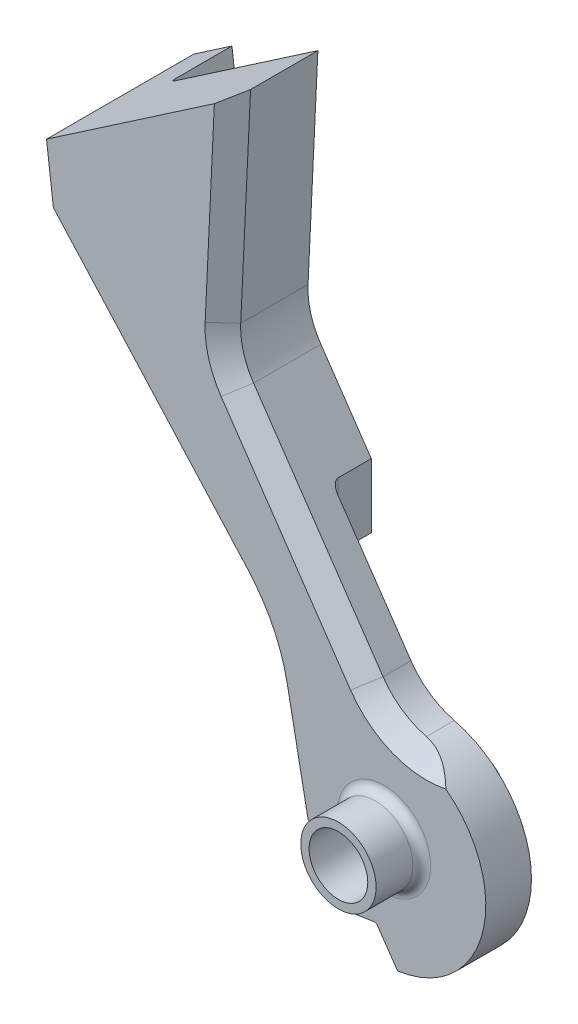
ISO-10303-21;
HEADER;
FILE_DESCRIPTION(('STEP AP214'),'2;1');
FILE_NAME('part.step','',(''),(''),'','','');
FILE_SCHEMA(('AUTOMOTIVE_DESIGN { 1 0 10303 214 1 1 1 1 }'));
ENDSEC;
DATA;
#1=APPLICATION_CONTEXT('core data for automotive mechanical design processes');
#2=APPLICATION_PROTOCOL_DEFINITION('international standard','automotive_design',2000,#1);
#3=PRODUCT_CONTEXT('',#1,'mechanical');
#4=PRODUCT('Part','Part','',(#3));
#5=PRODUCT_RELATED_PRODUCT_CATEGORY('part','',(#4));
#6=PRODUCT_DEFINITION_FORMATION('','',#4);
#7=PRODUCT_DEFINITION_CONTEXT('part definition',#1,'design');
#8=PRODUCT_DEFINITION('design','',#6,#7);
#9=PRODUCT_DEFINITION_SHAPE('','',#8);
#10=(LENGTH_UNIT() NAMED_UNIT(*) SI_UNIT(.MILLI.,.METRE.));
#11=(NAMED_UNIT(*) PLANE_ANGLE_UNIT() SI_UNIT($,.RADIAN.));
#12=(NAMED_UNIT(*) SI_UNIT($,.STERADIAN.) SOLID_ANGLE_UNIT());
#13=UNCERTAINTY_MEASURE_WITH_UNIT(LENGTH_MEASURE(1.E-05),#10,'distance_accuracy_value','');
#14=(GEOMETRIC_REPRESENTATION_CONTEXT(3) GLOBAL_UNCERTAINTY_ASSIGNED_CONTEXT((#13)) GLOBAL_UNIT_ASSIGNED_CONTEXT((#10,
#11,#12)) REPRESENTATION_CONTEXT('',''));
#15=CARTESIAN_POINT('',(0.,0.,0.));
#16=DIRECTION('',(0.,0.,1.));
#17=DIRECTION('',(1.,0.,0.));
#18=AXIS2_PLACEMENT_3D('',#15,#16,#17);
#19=CARTESIAN_POINT('',(0.,0.,0.));
#20=DIRECTION('',(0.,0.,1.));
#21=DIRECTION('',(1.,0.,0.));
#22=AXIS2_PLACEMENT_3D('',#19,#20,#21);
#23=PLANE('',#22);
#24=DIRECTION('',(0.669130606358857,-0.743144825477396,0.));
#25=VECTOR('',#24,1.);
#26=CARTESIAN_POINT('',(0.60615256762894,0.545782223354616,0.));
#27=LINE('',#26,#25);
#28=CARTESIAN_POINT('',(-23.6414355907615,27.4754570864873,0.));
#29=VERTEX_POINT('',#28);
#30=CARTESIAN_POINT('',(-11.6865027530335,14.198159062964,0.));
#31=VERTEX_POINT('',#30);
#32=EDGE_CURVE('E480',#29,#31,#27,.T.);
#33=ORIENTED_EDGE('',*,*,#32,.F.);
#34=DIRECTION('',(0.121869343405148,-0.992546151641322,0.));
#35=VECTOR('',#34,1.);
#36=CARTESIAN_POINT('',(-25.148905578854,39.752814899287,0.));
#37=LINE('',#36,#35);
#38=CARTESIAN_POINT('',(-25.1809115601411,40.0134826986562,0.));
#39=VERTEX_POINT('',#38);
#40=EDGE_CURVE('E53',#29,#39,#37,.F.);
#41=ORIENTED_EDGE('',*,*,#40,.T.);
#42=DIRECTION('',(0.825724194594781,0.564074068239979,0.));
#43=VECTOR('',#42,1.);
#44=CARTESIAN_POINT('',(-26.6491152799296,39.0105138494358,0.));
#45=LINE('',#44,#43);
#46=CARTESIAN_POINT('',(-12.9595659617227,48.3622075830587,0.));
#47=VERTEX_POINT('',#46);
#48=EDGE_CURVE('E478',#39,#47,#45,.T.);
#49=ORIENTED_EDGE('',*,*,#48,.T.);
#50=DIRECTION('',(-0.0474551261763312,-0.998873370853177,0.));
#51=VECTOR('',#50,1.);
#52=CARTESIAN_POINT('',(-15.2228301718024,0.723216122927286,0.));
#53=LINE('',#52,#51);
#54=CARTESIAN_POINT('',(-13.8035749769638,30.5968322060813,0.));
#55=VERTEX_POINT('',#54);
#56=EDGE_CURVE('E475',#47,#55,#53,.T.);
#57=ORIENTED_EDGE('',*,*,#56,.T.);
#58=CARTESIAN_POINT('',(-7.4607290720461,30.2954921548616,0.));
#59=DIRECTION('',(0.,0.,1.));
#60=DIRECTION('',(1.,0.,0.));
#61=AXIS2_PLACEMENT_3D('',#58,#59,#60);
#62=CIRCLE('',#61,6.35);
#63=CARTESIAN_POINT('',(-12.7040777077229,26.7136218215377,0.));
#64=VERTEX_POINT('',#63);
#65=EDGE_CURVE('E435',#55,#64,#62,.T.);
#66=ORIENTED_EDGE('',*,*,#65,.T.);
#67=DIRECTION('',(0.564074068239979,-0.825724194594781,0.));
#68=VECTOR('',#67,1.);
#69=CARTESIAN_POINT('',(3.7804931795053,2.58255502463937,0.));
#70=LINE('',#69,#68);
#71=CARTESIAN_POINT('',(-8.382,20.3867148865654,0.));
#72=VERTEX_POINT('',#71);
#73=EDGE_CURVE('E234',#64,#72,#70,.T.);
#74=ORIENTED_EDGE('',*,*,#73,.T.);
#75=DIRECTION('',(0.,1.,0.));
#76=VECTOR('',#75,1.);
#77=CARTESIAN_POINT('',(-8.382,24.13,0.));
#78=LINE('',#77,#76);
#79=CARTESIAN_POINT('',(-8.382,14.8838210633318,0.));
#80=VERTEX_POINT('',#79);
#81=EDGE_CURVE('E218',#80,#72,#78,.T.);
#82=ORIENTED_EDGE('',*,*,#81,.F.);
#83=DIRECTION('',(-0.825724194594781,-0.564074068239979,0.));
#84=VECTOR('',#83,1.);
#85=CARTESIAN_POINT('',(-9.59941249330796,14.052174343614,0.));
#86=LINE('',#85,#84);
#87=CARTESIAN_POINT('',(-10.8599833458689,13.1910450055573,0.));
#88=VERTEX_POINT('',#87);
#89=EDGE_CURVE('E230',#80,#88,#86,.T.);
#90=ORIENTED_EDGE('',*,*,#89,.T.);
#91=CARTESIAN_POINT('',(-22.256994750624,4.68044531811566,0.));
#92=DIRECTION('',(0.,0.,1.));
#93=DIRECTION('',(1.,0.,0.));
#94=AXIS2_PLACEMENT_3D('',#91,#92,#93);
#95=CIRCLE('',#94,14.224);
#96=EDGE_CURVE('E433',#31,#88,#95,.F.);
#97=ORIENTED_EDGE('',*,*,#96,.F.);
#98=EDGE_LOOP('',(#33,#41,#49,#57,#66,#74,#82,#90,#97));
#99=FACE_BOUND('',#98,.T.);
#100=ADVANCED_FACE('F37',(#99),#23,.F.);
#101=CARTESIAN_POINT('',(0.,0.,7.2898));
#102=DIRECTION('',(0.,0.,1.));
#103=DIRECTION('',(1.,0.,0.));
#104=AXIS2_PLACEMENT_3D('',#101,#102,#103);
#105=PLANE('',#104);
#106=CARTESIAN_POINT('',(0.,0.,7.2898));
#107=DIRECTION('',(0.,0.,1.));
#108=DIRECTION('',(1.,0.,0.));
#109=AXIS2_PLACEMENT_3D('',#106,#107,#108);
#110=CIRCLE('',#109,3.9878);
#111=CARTESIAN_POINT('',(3.9878,0.,7.2898));
#112=VERTEX_POINT('',#111);
#113=EDGE_CURVE('E257',#112,#112,#110,.F.);
#114=ORIENTED_EDGE('',*,*,#113,.T.);
#115=EDGE_LOOP('',(#114));
#116=FACE_BOUND('',#115,.T.);
#117=CARTESIAN_POINT('',(0.,-0.5588,7.2898));
#118=DIRECTION('',(0.,0.,1.));
#119=DIRECTION('',(1.,0.,0.));
#120=AXIS2_PLACEMENT_3D('',#117,#118,#119);
#121=CIRCLE('',#120,8.7122);
#122=CARTESIAN_POINT('',(1.15333806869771,-9.19432199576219,7.2898));
#123=VERTEX_POINT('',#122);
#124=CARTESIAN_POINT('',(5.29143049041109,6.36241320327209,7.2898));
#125=VERTEX_POINT('',#124);
#126=EDGE_CURVE('E458',#123,#125,#121,.T.);
#127=ORIENTED_EDGE('',*,*,#126,.T.);
#128=CARTESIAN_POINT('',(3.63065940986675,14.0592772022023,7.2898));
#129=DIRECTION('',(0.,0.,1.));
#130=DIRECTION('',(1.,0.,0.));
#131=AXIS2_PLACEMENT_3D('',#128,#129,#130);
#132=CIRCLE('',#131,7.874);
#133=CARTESIAN_POINT('',(-2.87109289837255,9.61775798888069,7.2898));
#134=VERTEX_POINT('',#133);
#135=EDGE_CURVE('E278',#125,#134,#132,.F.);
#136=ORIENTED_EDGE('',*,*,#135,.T.);
#137=DIRECTION('',(-0.564074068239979,0.825724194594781,0.));
#138=VECTOR('',#137,1.);
#139=CARTESIAN_POINT('',(2.52208950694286,1.72290614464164,7.2898));
#140=LINE('',#139,#138);
#141=CARTESIAN_POINT('',(-13.9624813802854,25.85397294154,7.2898));
#142=VERTEX_POINT('',#141);
#143=EDGE_CURVE('E271',#134,#142,#140,.T.);
#144=ORIENTED_EDGE('',*,*,#143,.T.);
#145=CARTESIAN_POINT('',(-7.4607290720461,30.2954921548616,7.2898));
#146=DIRECTION('',(0.,0.,1.));
#147=DIRECTION('',(1.,0.,0.));
#148=AXIS2_PLACEMENT_3D('',#145,#146,#147);
#149=CIRCLE('',#148,7.87400000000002);
#150=CARTESIAN_POINT('',(-15.325857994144,30.6691538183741,7.2898));
#151=VERTEX_POINT('',#150);
#152=EDGE_CURVE('E265',#142,#151,#149,.F.);
#153=ORIENTED_EDGE('',*,*,#152,.T.);
#154=DIRECTION('',(0.0474551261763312,0.998873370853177,0.));
#155=VECTOR('',#154,1.);
#156=CARTESIAN_POINT('',(-16.7451131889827,0.795537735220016,7.2898));
#157=LINE('',#156,#155);
#158=CARTESIAN_POINT('',(-14.5364621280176,47.2849880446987,7.2898));
#159=VERTEX_POINT('',#158);
#160=EDGE_CURVE('E263',#151,#159,#157,.T.);
#161=ORIENTED_EDGE('',*,*,#160,.T.);
#162=DIRECTION('',(0.825724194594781,0.564074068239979,0.));
#163=VECTOR('',#162,1.);
#164=CARTESIAN_POINT('',(-26.6491152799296,39.0105138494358,7.2898));
#165=LINE('',#164,#163);
#166=CARTESIAN_POINT('',(-28.9113505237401,37.4651210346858,7.2898));
#167=VERTEX_POINT('',#166);
#168=EDGE_CURVE('E461',#167,#159,#165,.T.);
#169=ORIENTED_EDGE('',*,*,#168,.F.);
#170=DIRECTION('',(-0.121869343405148,0.992546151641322,0.));
#171=VECTOR('',#170,1.);
#172=CARTESIAN_POINT('',(-23.9501386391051,-2.94070725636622,7.2898));
#173=LINE('',#172,#171);
#174=CARTESIAN_POINT('',(-28.3232090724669,32.6750933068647,7.2898));
#175=VERTEX_POINT('',#174);
#176=EDGE_CURVE('E464',#175,#167,#173,.T.);
#177=ORIENTED_EDGE('',*,*,#176,.F.);
#178=DIRECTION('',(0.669130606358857,-0.743144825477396,0.));
#179=VECTOR('',#178,1.);
#180=CARTESIAN_POINT('',(0.60615256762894,0.545782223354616,7.2898));
#181=LINE('',#180,#179);
#182=CARTESIAN_POINT('',(-11.6865027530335,14.198159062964,7.2898));
#183=VERTEX_POINT('',#182);
#184=EDGE_CURVE('E467',#175,#183,#181,.T.);
#185=ORIENTED_EDGE('',*,*,#184,.T.);
#186=CARTESIAN_POINT('',(-22.256994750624,4.68044531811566,7.2898));
#187=DIRECTION('',(0.,0.,1.));
#188=DIRECTION('',(1.,0.,0.));
#189=AXIS2_PLACEMENT_3D('',#186,#187,#188);
#190=CIRCLE('',#189,14.224);
#191=CARTESIAN_POINT('',(-8.29432969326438,7.39451246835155,7.2898));
#192=VERTEX_POINT('',#191);
#193=EDGE_CURVE('E469',#183,#192,#190,.F.);
#194=ORIENTED_EDGE('',*,*,#193,.T.);
#195=DIRECTION('',(0.190808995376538,-0.981627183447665,0.));
#196=VECTOR('',#195,1.);
#197=CARTESIAN_POINT('',(-6.60733257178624,-1.28433534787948,7.2898));
#198=LINE('',#197,#196);
#199=CARTESIAN_POINT('',(-6.50735484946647,-1.79867614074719,7.2898));
#200=VERTEX_POINT('',#199);
#201=EDGE_CURVE('E471',#192,#200,#198,.T.);
#202=ORIENTED_EDGE('',*,*,#201,.T.);
#203=DIRECTION('',(-0.813100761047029,0.582122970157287,0.));
#204=VECTOR('',#203,1.);
#205=CARTESIAN_POINT('',(-3.05648652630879,-4.26925520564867,7.2898));
#206=LINE('',#205,#204);
#207=CARTESIAN_POINT('',(-3.38169817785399,-4.03642653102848,7.2898));
#208=VERTEX_POINT('',#207);
#209=EDGE_CURVE('E441',#208,#200,#206,.T.);
#210=ORIENTED_EDGE('',*,*,#209,.F.);
#211=CARTESIAN_POINT('',(-3.52955741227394,-4.24295412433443,7.2898));
#212=DIRECTION('',(0.,0.,1.));
#213=DIRECTION('',(1.,0.,0.));
#214=AXIS2_PLACEMENT_3D('',#211,#212,#213);
#215=CIRCLE('',#214,0.254);
#216=CARTESIAN_POINT('',(-3.29506201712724,-4.34056513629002,7.2898));
#217=VERTEX_POINT('',#216);
#218=EDGE_CURVE('E444',#208,#217,#215,.F.);
#219=ORIENTED_EDGE('',*,*,#218,.T.);
#220=DIRECTION('',(0.384295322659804,0.923210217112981,0.));
#221=VECTOR('',#220,1.);
#222=CARTESIAN_POINT('',(-1.26846871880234,0.528012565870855,7.2898));
#223=LINE('',#222,#221);
#224=CARTESIAN_POINT('',(-4.1190259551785,-6.32001136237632,7.2898));
#225=VERTEX_POINT('',#224);
#226=EDGE_CURVE('E446',#225,#217,#223,.T.);
#227=ORIENTED_EDGE('',*,*,#226,.F.);
#228=CARTESIAN_POINT('',(0.,0.,7.2898));
#229=DIRECTION('',(0.,0.,1.));
#230=DIRECTION('',(1.,0.,0.));
#231=AXIS2_PLACEMENT_3D('',#228,#229,#230);
#232=CIRCLE('',#231,7.5438);
#233=CARTESIAN_POINT('',(-3.07186405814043,-6.89003408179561,7.2898));
#234=VERTEX_POINT('',#233);
#235=EDGE_CURVE('E449',#225,#234,#232,.T.);
#236=ORIENTED_EDGE('',*,*,#235,.T.);
#237=DIRECTION('',(-0.98863803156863,-0.15031580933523,0.));
#238=VECTOR('',#237,1.);
#239=CARTESIAN_POINT('',(0.954505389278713,-6.2778515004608,7.2898));
#240=LINE('',#239,#238);
#241=CARTESIAN_POINT('',(-0.847081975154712,-6.55177082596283,7.2898));
#242=VERTEX_POINT('',#241);
#243=EDGE_CURVE('E451',#242,#234,#240,.T.);
#244=ORIENTED_EDGE('',*,*,#243,.F.);
#245=CARTESIAN_POINT('',(-0.808901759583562,-6.80288488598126,7.2898));
#246=DIRECTION('',(0.,0.,1.));
#247=DIRECTION('',(1.,0.,0.));
#248=AXIS2_PLACEMENT_3D('',#245,#246,#247);
#249=CIRCLE('',#248,0.254);
#250=CARTESIAN_POINT('',(-0.599976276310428,-6.65843370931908,7.2898));
#251=VERTEX_POINT('',#250);
#252=EDGE_CURVE('E454',#242,#251,#249,.F.);
#253=ORIENTED_EDGE('',*,*,#252,.T.);
#254=DIRECTION('',(0.568705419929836,-0.82254127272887,0.));
#255=VECTOR('',#254,1.);
#256=CARTESIAN_POINT('',(-3.52063505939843,-2.43416872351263,7.2898));
#257=LINE('',#256,#255);
#258=EDGE_CURVE('E456',#251,#123,#257,.T.);
#259=ORIENTED_EDGE('',*,*,#258,.T.);
#260=EDGE_LOOP('',(#127,#136,#144,#153,#161,#169,#177,#185,#194,#202,#210,#219,#227,#236,#244,
#253,#259));
#261=FACE_BOUND('',#260,.T.);
#262=ADVANCED_FACE('F332',(#116,#261),#105,.T.);
#263=CARTESIAN_POINT('',(-3.05648652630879,-4.26925520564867,7.2898));
#264=DIRECTION('',(-0.582122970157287,-0.813100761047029,0.));
#265=DIRECTION('',(0.813100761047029,-0.582122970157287,0.));
#266=AXIS2_PLACEMENT_3D('',#263,#264,#265);
#267=PLANE('',#266);
#268=DIRECTION('',(-0.813100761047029,0.582122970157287,0.));
#269=VECTOR('',#268,1.);
#270=CARTESIAN_POINT('',(-3.05648652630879,-4.26925520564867,3.3782));
#271=LINE('',#270,#269);
#272=CARTESIAN_POINT('',(-3.38169817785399,-4.03642653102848,3.3782));
#273=VERTEX_POINT('',#272);
#274=CARTESIAN_POINT('',(-6.50735484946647,-1.79867614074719,3.3782));
#275=VERTEX_POINT('',#274);
#276=EDGE_CURVE('E530',#273,#275,#271,.T.);
#277=ORIENTED_EDGE('',*,*,#276,.F.);
#278=DIRECTION('',(0.,0.,-1.));
#279=VECTOR('',#278,1.);
#280=CARTESIAN_POINT('',(-3.38169817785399,-4.03642653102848,7.2898));
#281=LINE('',#280,#279);
#282=EDGE_CURVE('E242',#208,#273,#281,.T.);
#283=ORIENTED_EDGE('',*,*,#282,.F.);
#284=ORIENTED_EDGE('',*,*,#209,.T.);
#285=DIRECTION('',(0.,0.,-1.));
#286=VECTOR('',#285,1.);
#287=CARTESIAN_POINT('',(-6.50735484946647,-1.79867614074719,7.2898));
#288=LINE('',#287,#286);
#289=EDGE_CURVE('E472',#200,#275,#288,.T.);
#290=ORIENTED_EDGE('',*,*,#289,.T.);
#291=EDGE_LOOP('',(#277,#283,#284,#290));
#292=FACE_BOUND('',#291,.T.);
#293=ADVANCED_FACE('F328',(#292),#267,.T.);
#294=CARTESIAN_POINT('',(-3.52955741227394,-4.24295412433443,7.2898));
#295=DIRECTION('',(0.,0.,-1.));
#296=DIRECTION('',(-1.,0.,0.));
#297=AXIS2_PLACEMENT_3D('',#294,#295,#296);
#298=CYLINDRICAL_SURFACE('',#297,0.254);
#299=ORIENTED_EDGE('',*,*,#282,.T.);
#300=CARTESIAN_POINT('',(-3.52955741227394,-4.24295412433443,3.3782));
#301=DIRECTION('',(0.,0.,1.));
#302=DIRECTION('',(1.,0.,0.));
#303=AXIS2_PLACEMENT_3D('',#300,#301,#302);
#304=CIRCLE('',#303,0.254);
#305=CARTESIAN_POINT('',(-3.29506201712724,-4.34056513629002,3.3782));
#306=VERTEX_POINT('',#305);
#307=EDGE_CURVE('E527',#273,#306,#304,.F.);
#308=ORIENTED_EDGE('',*,*,#307,.T.);
#309=DIRECTION('',(0.,0.,-1.));
#310=VECTOR('',#309,1.);
#311=CARTESIAN_POINT('',(-3.29506201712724,-4.34056513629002,7.2898));
#312=LINE('',#311,#310);
#313=EDGE_CURVE('E248',#217,#306,#312,.T.);
#314=ORIENTED_EDGE('',*,*,#313,.F.);
#315=ORIENTED_EDGE('',*,*,#218,.F.);
#316=EDGE_LOOP('',(#299,#308,#314,#315));
#317=FACE_BOUND('',#316,.T.);
#318=ADVANCED_FACE('F324',(#317),#298,.F.);
#319=CARTESIAN_POINT('',(-1.26846871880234,0.528012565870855,7.2898));
#320=DIRECTION('',(-0.923210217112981,0.384295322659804,0.));
#321=DIRECTION('',(-0.384295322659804,-0.923210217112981,0.));
#322=AXIS2_PLACEMENT_3D('',#319,#320,#321);
#323=PLANE('',#322);
#324=DIRECTION('',(0.384295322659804,0.923210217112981,0.));
#325=VECTOR('',#324,1.);
#326=CARTESIAN_POINT('',(-1.26846871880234,0.528012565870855,3.3782));
#327=LINE('',#326,#325);
#328=CARTESIAN_POINT('',(-4.1190259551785,-6.32001136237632,3.3782));
#329=VERTEX_POINT('',#328);
#330=EDGE_CURVE('E522',#329,#306,#327,.T.);
#331=ORIENTED_EDGE('',*,*,#330,.F.);
#332=DIRECTION('',(0.,0.,-1.));
#333=VECTOR('',#332,1.);
#334=CARTESIAN_POINT('',(-4.1190259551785,-6.32001136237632,7.2898));
#335=LINE('',#334,#333);
#336=EDGE_CURVE('E517',#225,#329,#335,.T.);
#337=ORIENTED_EDGE('',*,*,#336,.F.);
#338=ORIENTED_EDGE('',*,*,#226,.T.);
#339=ORIENTED_EDGE('',*,*,#313,.T.);
#340=EDGE_LOOP('',(#331,#337,#338,#339));
#341=FACE_BOUND('',#340,.T.);
#342=ADVANCED_FACE('F320',(#341),#323,.T.);
#343=CARTESIAN_POINT('',(0.,0.,7.2898));
#344=DIRECTION('',(0.,0.,-1.));
#345=DIRECTION('',(-1.,0.,0.));
#346=AXIS2_PLACEMENT_3D('',#343,#344,#345);
#347=CYLINDRICAL_SURFACE('',#346,7.5438);
#348=ORIENTED_EDGE('',*,*,#336,.T.);
#349=CARTESIAN_POINT('',(0.,0.,3.3782));
#350=DIRECTION('',(0.,0.,1.));
#351=DIRECTION('',(1.,0.,0.));
#352=AXIS2_PLACEMENT_3D('',#349,#350,#351);
#353=CIRCLE('',#352,7.5438);
#354=CARTESIAN_POINT('',(-3.07186405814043,-6.89003408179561,3.3782));
#355=VERTEX_POINT('',#354);
#356=EDGE_CURVE('E532',#329,#355,#353,.T.);
#357=ORIENTED_EDGE('',*,*,#356,.T.);
#358=DIRECTION('',(0.,0.,-1.));
#359=VECTOR('',#358,1.);
#360=CARTESIAN_POINT('',(-3.07186405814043,-6.89003408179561,7.2898));
#361=LINE('',#360,#359);
#362=EDGE_CURVE('E514',#234,#355,#361,.T.);
#363=ORIENTED_EDGE('',*,*,#362,.F.);
#364=ORIENTED_EDGE('',*,*,#235,.F.);
#365=EDGE_LOOP('',(#348,#357,#363,#364));
#366=FACE_BOUND('',#365,.T.);
#367=ADVANCED_FACE('F316',(#366),#347,.T.);
#368=CARTESIAN_POINT('',(0.954505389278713,-6.2778515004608,7.2898));
#369=DIRECTION('',(0.15031580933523,-0.98863803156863,0.));
#370=DIRECTION('',(0.98863803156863,0.15031580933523,0.));
#371=AXIS2_PLACEMENT_3D('',#368,#369,#370);
#372=PLANE('',#371);
#373=DIRECTION('',(-0.98863803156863,-0.15031580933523,0.));
#374=VECTOR('',#373,1.);
#375=CARTESIAN_POINT('',(0.954505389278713,-6.2778515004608,3.3782));
#376=LINE('',#375,#374);
#377=CARTESIAN_POINT('',(-0.847081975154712,-6.55177082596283,3.3782));
#378=VERTEX_POINT('',#377);
#379=EDGE_CURVE('E540',#378,#355,#376,.T.);
#380=ORIENTED_EDGE('',*,*,#379,.F.);
#381=DIRECTION('',(0.,0.,-1.));
#382=VECTOR('',#381,1.);
#383=CARTESIAN_POINT('',(-0.847081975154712,-6.55177082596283,7.2898));
#384=LINE('',#383,#382);
#385=EDGE_CURVE('E511',#242,#378,#384,.T.);
#386=ORIENTED_EDGE('',*,*,#385,.F.);
#387=ORIENTED_EDGE('',*,*,#243,.T.);
#388=ORIENTED_EDGE('',*,*,#362,.T.);
#389=EDGE_LOOP('',(#380,#386,#387,#388));
#390=FACE_BOUND('',#389,.T.);
#391=ADVANCED_FACE('F312',(#390),#372,.T.);
#392=CARTESIAN_POINT('',(-0.808901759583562,-6.80288488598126,7.2898));
#393=DIRECTION('',(0.,0.,-1.));
#394=DIRECTION('',(-1.,0.,0.));
#395=AXIS2_PLACEMENT_3D('',#392,#393,#394);
#396=CYLINDRICAL_SURFACE('',#395,0.254);
#397=ORIENTED_EDGE('',*,*,#385,.T.);
#398=CARTESIAN_POINT('',(-0.808901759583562,-6.80288488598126,3.3782));
#399=DIRECTION('',(0.,0.,1.));
#400=DIRECTION('',(1.,0.,0.));
#401=AXIS2_PLACEMENT_3D('',#398,#399,#400);
#402=CIRCLE('',#401,0.254);
#403=CARTESIAN_POINT('',(-0.599976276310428,-6.65843370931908,3.3782));
#404=VERTEX_POINT('',#403);
#405=EDGE_CURVE('E542',#378,#404,#402,.F.);
#406=ORIENTED_EDGE('',*,*,#405,.T.);
#407=DIRECTION('',(0.,0.,-1.));
#408=VECTOR('',#407,1.);
#409=CARTESIAN_POINT('',(-0.599976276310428,-6.65843370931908,7.2898));
#410=LINE('',#409,#408);
#411=EDGE_CURVE('E508',#251,#404,#410,.T.);
#412=ORIENTED_EDGE('',*,*,#411,.F.);
#413=ORIENTED_EDGE('',*,*,#252,.F.);
#414=EDGE_LOOP('',(#397,#406,#412,#413));
#415=FACE_BOUND('',#414,.T.);
#416=ADVANCED_FACE('F308',(#415),#396,.F.);
#417=CARTESIAN_POINT('',(-3.52063505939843,-2.43416872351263,7.2898));
#418=DIRECTION('',(0.82254127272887,0.568705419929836,0.));
#419=DIRECTION('',(-0.568705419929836,0.82254127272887,0.));
#420=AXIS2_PLACEMENT_3D('',#417,#418,#419);
#421=PLANE('',#420);
#422=ORIENTED_EDGE('',*,*,#411,.T.);
#423=DIRECTION('',(0.568705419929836,-0.82254127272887,0.));
#424=VECTOR('',#423,1.);
#425=CARTESIAN_POINT('',(-3.52063505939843,-2.43416872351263,3.3782));
#426=LINE('',#425,#424);
#427=CARTESIAN_POINT('',(1.15333806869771,-9.19432199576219,3.3782));
#428=VERTEX_POINT('',#427);
#429=EDGE_CURVE('E545',#404,#428,#426,.T.);
#430=ORIENTED_EDGE('',*,*,#429,.T.);
#431=DIRECTION('',(0.,0.,-1.));
#432=VECTOR('',#431,1.);
#433=CARTESIAN_POINT('',(1.15333806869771,-9.19432199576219,7.2898));
#434=LINE('',#433,#432);
#435=EDGE_CURVE('E505',#123,#428,#434,.T.);
#436=ORIENTED_EDGE('',*,*,#435,.F.);
#437=ORIENTED_EDGE('',*,*,#258,.F.);
#438=EDGE_LOOP('',(#422,#430,#436,#437));
#439=FACE_BOUND('',#438,.T.);
#440=ADVANCED_FACE('F303',(#439),#421,.F.);
#441=CARTESIAN_POINT('',(0.,-0.5588,7.2898));
#442=DIRECTION('',(0.,0.,-1.));
#443=DIRECTION('',(-1.,0.,0.));
#444=AXIS2_PLACEMENT_3D('',#441,#442,#443);
#445=CYLINDRICAL_SURFACE('',#444,8.7122);
#446=DIRECTION('',(0.,0.,-1.));
#447=VECTOR('',#446,1.);
#448=CARTESIAN_POINT('',(2.10002728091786,7.89651278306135,7.2898));
#449=LINE('',#448,#447);
#450=CARTESIAN_POINT('',(2.10002728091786,7.89651278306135,5.76580000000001));
#451=VERTEX_POINT('',#450);
#452=CARTESIAN_POINT('',(2.10002728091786,7.89651278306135,3.3782));
#453=VERTEX_POINT('',#452);
#454=EDGE_CURVE('E503',#451,#453,#449,.T.);
#455=ORIENTED_EDGE('',*,*,#454,.F.);
#456=CARTESIAN_POINT('',(2.10002728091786,7.89651278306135,5.76580000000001));
#457=CARTESIAN_POINT('',(2.20985746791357,7.86925970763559,5.76571751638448));
#458=CARTESIAN_POINT('',(2.31909260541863,7.83983339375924,5.77102705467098));
#459=CARTESIAN_POINT('',(2.53523958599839,7.77711693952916,5.79178216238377));
#460=CARTESIAN_POINT('',(2.64215566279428,7.74383469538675,5.80720730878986));
#461=CARTESIAN_POINT('',(2.85136839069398,7.6743117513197,5.84724182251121));
#462=CARTESIAN_POINT('',(2.9537106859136,7.63812409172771,5.87170709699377));
#463=CARTESIAN_POINT('',(3.1549813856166,7.56278063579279,5.92886439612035));
#464=CARTESIAN_POINT('',(3.25390790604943,7.52362323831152,5.96156088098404));
#465=CARTESIAN_POINT('',(3.4849134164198,7.4273672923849,6.04791174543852));
#466=CARTESIAN_POINT('',(3.61529649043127,7.36910792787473,6.10480793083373));
#467=CARTESIAN_POINT('',(3.8687568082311,7.2485601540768,6.22951557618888));
#468=CARTESIAN_POINT('',(3.99183041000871,7.18626976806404,6.29733241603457));
#469=CARTESIAN_POINT('',(4.23182104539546,7.05781220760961,6.44207361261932));
#470=CARTESIAN_POINT('',(4.34868550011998,6.99161965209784,6.5190619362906));
#471=CARTESIAN_POINT('',(4.5757160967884,6.85623294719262,6.67981944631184));
#472=CARTESIAN_POINT('',(4.68588420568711,6.7870396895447,6.76358662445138));
#473=CARTESIAN_POINT('',(4.88030122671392,6.65895775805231,6.92048907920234));
#474=CARTESIAN_POINT('',(4.96557985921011,6.60052553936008,6.99273142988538));
#475=CARTESIAN_POINT('',(5.13161083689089,6.48245390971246,7.13954443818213));
#476=CARTESIAN_POINT('',(5.21239538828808,6.42282890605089,7.21409020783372));
#477=CARTESIAN_POINT('',(5.29143049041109,6.36241320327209,7.2898));
#478=B_SPLINE_CURVE_WITH_KNOTS('',3,(#456,#457,#458,#459,#460,#461,#462,#463,#464,#465,#466,
#467,#468,#469,#470,#471,#472,#473,#474,#475,#476,#477),.UNSPECIFIED.,.F.,.F.,(4,2,2,2,2,2,2,2,
2,2,4),(0.,0.339250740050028,0.677818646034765,1.01120774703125,1.34477789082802,
1.80517500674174,2.26579962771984,2.72984907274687,3.19376154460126,3.57201229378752,
3.94706091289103),.UNSPECIFIED.);
#479=EDGE_CURVE('E283',#451,#125,#478,.T.);
#480=ORIENTED_EDGE('',*,*,#479,.T.);
#481=ORIENTED_EDGE('',*,*,#126,.F.);
#482=ORIENTED_EDGE('',*,*,#435,.T.);
#483=CARTESIAN_POINT('',(0.,-0.5588,3.3782));
#484=DIRECTION('',(0.,0.,1.));
#485=DIRECTION('',(1.,0.,0.));
#486=AXIS2_PLACEMENT_3D('',#483,#484,#485);
#487=CIRCLE('',#486,8.7122);
#488=EDGE_CURVE('E548',#428,#453,#487,.T.);
#489=ORIENTED_EDGE('',*,*,#488,.T.);
#490=EDGE_LOOP('',(#455,#480,#481,#482,#489));
#491=FACE_BOUND('',#490,.T.);
#492=ADVANCED_FACE('F297',(#491),#445,.T.);
#493=CARTESIAN_POINT('',(3.63065940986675,14.0592772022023,7.2898));
#494=DIRECTION('',(0.,0.,-1.));
#495=DIRECTION('',(-1.,0.,0.));
#496=AXIS2_PLACEMENT_3D('',#493,#494,#495);
#497=CYLINDRICAL_SURFACE('',#496,6.35);
#498=DIRECTION('',(0.,0.,-1.));
#499=VECTOR('',#498,1.);
#500=CARTESIAN_POINT('',(-1.61268922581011,10.4774068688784,7.2898));
#501=LINE('',#500,#499);
#502=CARTESIAN_POINT('',(-1.61268922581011,10.4774068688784,5.76580000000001));
#503=VERTEX_POINT('',#502);
#504=CARTESIAN_POINT('',(-1.61268922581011,10.4774068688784,3.3782));
#505=VERTEX_POINT('',#504);
#506=EDGE_CURVE('E501',#503,#505,#501,.T.);
#507=ORIENTED_EDGE('',*,*,#506,.F.);
#508=CARTESIAN_POINT('',(3.63065940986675,14.0592772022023,5.76580000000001));
#509=DIRECTION('',(0.,0.,1.));
#510=DIRECTION('',(1.,0.,0.));
#511=AXIS2_PLACEMENT_3D('',#508,#509,#510);
#512=CIRCLE('',#511,6.35);
#513=EDGE_CURVE('E281',#503,#451,#512,.T.);
#514=ORIENTED_EDGE('',*,*,#513,.T.);
#515=ORIENTED_EDGE('',*,*,#454,.T.);
#516=CARTESIAN_POINT('',(3.63065940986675,14.0592772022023,3.3782));
#517=DIRECTION('',(0.,0.,1.));
#518=DIRECTION('',(1.,0.,0.));
#519=AXIS2_PLACEMENT_3D('',#516,#517,#518);
#520=CIRCLE('',#519,6.35);
#521=EDGE_CURVE('E437',#453,#505,#520,.F.);
#522=ORIENTED_EDGE('',*,*,#521,.T.);
#523=EDGE_LOOP('',(#507,#514,#515,#522));
#524=FACE_BOUND('',#523,.T.);
#525=ADVANCED_FACE('F302',(#524),#497,.F.);
#526=CARTESIAN_POINT('',(3.7804931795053,2.58255502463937,7.2898));
#527=DIRECTION('',(0.825724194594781,0.564074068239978,0.));
#528=DIRECTION('',(-0.564074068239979,0.825724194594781,0.));
#529=AXIS2_PLACEMENT_3D('',#526,#527,#528);
#530=PLANE('',#529);
#531=DIRECTION('',(0.564074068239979,-0.825724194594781,0.));
#532=VECTOR('',#531,1.);
#533=CARTESIAN_POINT('',(3.7804931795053,2.58255502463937,3.3782));
#534=LINE('',#533,#532);
#535=CARTESIAN_POINT('',(-7.874,19.6430751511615,3.3782));
#536=VERTEX_POINT('',#535);
#537=EDGE_CURVE('E423',#536,#505,#534,.T.);
#538=ORIENTED_EDGE('',*,*,#537,.F.);
#539=CARTESIAN_POINT('',(-7.874,19.6430751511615,2.8702));
#540=DIRECTION('',(0.825724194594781,0.564074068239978,0.));
#541=DIRECTION('',(0.564074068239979,-0.825724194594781,0.));
#542=AXIS2_PLACEMENT_3D('',#539,#540,#541);
#543=ELLIPSE('',#542,0.900590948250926,0.508);
#544=CARTESIAN_POINT('',(-8.382,20.3867148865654,2.8702));
#545=VERTEX_POINT('',#544);
#546=EDGE_CURVE('E384',#536,#545,#543,.F.);
#547=ORIENTED_EDGE('',*,*,#546,.T.);
#548=DIRECTION('',(0.,0.,1.));
#549=VECTOR('',#548,1.);
#550=CARTESIAN_POINT('',(-8.382,20.3867148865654,7.2898));
#551=LINE('',#550,#549);
#552=EDGE_CURVE('E235',#72,#545,#551,.T.);
#553=ORIENTED_EDGE('',*,*,#552,.F.);
#554=ORIENTED_EDGE('',*,*,#73,.F.);
#555=DIRECTION('',(0.,0.,-1.));
#556=VECTOR('',#555,1.);
#557=CARTESIAN_POINT('',(-12.7040777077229,26.7136218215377,7.2898));
#558=LINE('',#557,#556);
#559=CARTESIAN_POINT('',(-12.7040777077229,26.7136218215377,5.76579999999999));
#560=VERTEX_POINT('',#559);
#561=EDGE_CURVE('E499',#560,#64,#558,.T.);
#562=ORIENTED_EDGE('',*,*,#561,.F.);
#563=DIRECTION('',(0.564074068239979,-0.825724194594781,0.));
#564=VECTOR('',#563,1.);
#565=CARTESIAN_POINT('',(3.7804931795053,2.58255502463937,5.76580000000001));
#566=LINE('',#565,#564);
#567=EDGE_CURVE('E291',#560,#503,#566,.T.);
#568=ORIENTED_EDGE('',*,*,#567,.T.);
#569=ORIENTED_EDGE('',*,*,#506,.T.);
#570=EDGE_LOOP('',(#538,#547,#553,#554,#562,#568,#569));
#571=FACE_BOUND('',#570,.T.);
#572=ADVANCED_FACE('F421',(#571),#530,.T.);
#573=CARTESIAN_POINT('',(-7.4607290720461,30.2954921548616,7.2898));
#574=DIRECTION('',(0.,0.,-1.));
#575=DIRECTION('',(-1.,0.,0.));
#576=AXIS2_PLACEMENT_3D('',#573,#574,#575);
#577=CYLINDRICAL_SURFACE('',#576,6.35);
#578=DIRECTION('',(0.,0.,-1.));
#579=VECTOR('',#578,1.);
#580=CARTESIAN_POINT('',(-13.8035749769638,30.5968322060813,7.2898));
#581=LINE('',#580,#579);
#582=CARTESIAN_POINT('',(-13.8035749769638,30.5968322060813,5.76579999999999));
#583=VERTEX_POINT('',#582);
#584=EDGE_CURVE('E497',#583,#55,#581,.T.);
#585=ORIENTED_EDGE('',*,*,#584,.F.);
#586=CARTESIAN_POINT('',(-7.4607290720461,30.2954921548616,5.76579999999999));
#587=DIRECTION('',(0.,0.,1.));
#588=DIRECTION('',(1.,0.,0.));
#589=AXIS2_PLACEMENT_3D('',#586,#587,#588);
#590=CIRCLE('',#589,6.35);
#591=EDGE_CURVE('E260',#583,#560,#590,.T.);
#592=ORIENTED_EDGE('',*,*,#591,.T.);
#593=ORIENTED_EDGE('',*,*,#561,.T.);
#594=ORIENTED_EDGE('',*,*,#65,.F.);
#595=EDGE_LOOP('',(#585,#592,#593,#594));
#596=FACE_BOUND('',#595,.T.);
#597=ADVANCED_FACE('F560',(#596),#577,.F.);
#598=CARTESIAN_POINT('',(-15.2228301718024,0.723216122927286,7.2898));
#599=DIRECTION('',(0.998873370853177,-0.0474551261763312,0.));
#600=DIRECTION('',(0.0474551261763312,0.998873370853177,0.));
#601=AXIS2_PLACEMENT_3D('',#598,#599,#600);
#602=PLANE('',#601);
#603=DIRECTION('',(0.,0.,-1.));
#604=VECTOR('',#603,1.);
#605=CARTESIAN_POINT('',(-12.9595659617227,48.3622075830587,7.2898));
#606=LINE('',#605,#604);
#607=CARTESIAN_POINT('',(-12.9595659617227,48.3622075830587,5.76579999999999));
#608=VERTEX_POINT('',#607);
#609=EDGE_CURVE('E494',#608,#47,#606,.T.);
#610=ORIENTED_EDGE('',*,*,#609,.F.);
#611=DIRECTION('',(-0.0474551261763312,-0.998873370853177,0.));
#612=VECTOR('',#611,1.);
#613=CARTESIAN_POINT('',(-15.2228301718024,0.723216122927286,5.76579999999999));
#614=LINE('',#613,#612);
#615=EDGE_CURVE('E267',#608,#583,#614,.T.);
#616=ORIENTED_EDGE('',*,*,#615,.T.);
#617=ORIENTED_EDGE('',*,*,#584,.T.);
#618=ORIENTED_EDGE('',*,*,#56,.F.);
#619=EDGE_LOOP('',(#610,#616,#617,#618));
#620=FACE_BOUND('',#619,.T.);
#621=ADVANCED_FACE('F622',(#620),#602,.T.);
#622=CARTESIAN_POINT('',(-26.6491152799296,39.0105138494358,7.2898));
#623=DIRECTION('',(-0.564074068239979,0.825724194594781,0.));
#624=DIRECTION('',(-0.825724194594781,-0.564074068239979,0.));
#625=AXIS2_PLACEMENT_3D('',#622,#623,#624);
#626=PLANE('',#625);
#627=ORIENTED_EDGE('',*,*,#168,.T.);
#628=DIRECTION('',(-0.645403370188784,-0.440892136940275,0.623753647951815));
#629=VECTOR('',#628,1.);
#630=CARTESIAN_POINT('',(-21.9364621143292,42.2298520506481,14.4415708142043));
#631=LINE('',#630,#629);
#632=EDGE_CURVE('E269',#159,#608,#631,.F.);
#633=ORIENTED_EDGE('',*,*,#632,.T.);
#634=ORIENTED_EDGE('',*,*,#609,.T.);
#635=ORIENTED_EDGE('',*,*,#48,.F.);
#636=CARTESIAN_POINT('',(-25.1809115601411,40.0134826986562,-0.508));
#637=DIRECTION('',(-0.564074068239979,0.825724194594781,0.));
#638=DIRECTION('',(0.825724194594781,0.564074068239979,0.));
#639=AXIS2_PLACEMENT_3D('',#636,#637,#638);
#640=ELLIPSE('',#639,0.57187068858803,0.508);
#641=CARTESIAN_POINT('',(-25.6531190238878,39.6909052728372,-0.508));
#642=VERTEX_POINT('',#641);
#643=EDGE_CURVE('E11',#39,#642,#640,.F.);
#644=ORIENTED_EDGE('',*,*,#643,.T.);
#645=DIRECTION('',(0.,0.,1.));
#646=VECTOR('',#645,1.);
#647=CARTESIAN_POINT('',(-25.6531190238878,39.6909052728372,-5.334));
#648=LINE('',#647,#646);
#649=CARTESIAN_POINT('',(-25.6531190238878,39.6909052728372,-5.334));
#650=VERTEX_POINT('',#649);
#651=EDGE_CURVE('E408',#650,#642,#648,.T.);
#652=ORIENTED_EDGE('',*,*,#651,.F.);
#653=DIRECTION('',(0.82572419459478,0.56407406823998,0.));
#654=VECTOR('',#653,1.);
#655=CARTESIAN_POINT('',(-28.9113505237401,37.4651210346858,-5.334));
#656=LINE('',#655,#654);
#657=CARTESIAN_POINT('',(-28.9113505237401,37.4651210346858,-5.334));
#658=VERTEX_POINT('',#657);
#659=EDGE_CURVE('E572',#658,#650,#656,.T.);
#660=ORIENTED_EDGE('',*,*,#659,.F.);
#661=DIRECTION('',(0.,0.,-1.));
#662=VECTOR('',#661,1.);
#663=CARTESIAN_POINT('',(-28.9113505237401,37.4651210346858,7.2898));
#664=LINE('',#663,#662);
#665=EDGE_CURVE('E492',#167,#658,#664,.T.);
#666=ORIENTED_EDGE('',*,*,#665,.F.);
#667=EDGE_LOOP('',(#627,#633,#634,#635,#644,#652,#660,#666));
#668=FACE_BOUND('',#667,.T.);
#669=ADVANCED_FACE('F568',(#668),#626,.T.);
#670=CARTESIAN_POINT('',(-23.9501386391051,-2.94070725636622,7.2898));
#671=DIRECTION('',(-0.992546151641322,-0.121869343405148,0.));
#672=DIRECTION('',(0.121869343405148,-0.992546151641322,0.));
#673=AXIS2_PLACEMENT_3D('',#670,#671,#672);
#674=PLANE('',#673);
#675=ORIENTED_EDGE('',*,*,#665,.T.);
#676=DIRECTION('',(-0.121869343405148,0.992546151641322,0.));
#677=VECTOR('',#676,1.);
#678=CARTESIAN_POINT('',(-28.3232090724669,32.6750933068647,-5.334));
#679=LINE('',#678,#677);
#680=CARTESIAN_POINT('',(-28.3232090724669,32.6750933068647,-5.334));
#681=VERTEX_POINT('',#680);
#682=EDGE_CURVE('E425',#681,#658,#679,.T.);
#683=ORIENTED_EDGE('',*,*,#682,.F.);
#684=DIRECTION('',(0.,0.,-1.));
#685=VECTOR('',#684,1.);
#686=CARTESIAN_POINT('',(-28.3232090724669,32.6750933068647,7.2898));
#687=LINE('',#686,#685);
#688=EDGE_CURVE('E490',#175,#681,#687,.T.);
#689=ORIENTED_EDGE('',*,*,#688,.F.);
#690=ORIENTED_EDGE('',*,*,#176,.T.);
#691=EDGE_LOOP('',(#675,#683,#689,#690));
#692=FACE_BOUND('',#691,.T.);
#693=ADVANCED_FACE('F576',(#692),#674,.T.);
#694=CARTESIAN_POINT('',(0.60615256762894,0.545782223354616,7.2898));
#695=DIRECTION('',(0.743144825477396,0.669130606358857,0.));
#696=DIRECTION('',(-0.669130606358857,0.743144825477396,0.));
#697=AXIS2_PLACEMENT_3D('',#694,#695,#696);
#698=PLANE('',#697);
#699=ORIENTED_EDGE('',*,*,#688,.T.);
#700=DIRECTION('',(-0.669130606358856,0.743144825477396,0.));
#701=VECTOR('',#700,1.);
#702=CARTESIAN_POINT('',(-28.3232090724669,32.6750933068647,-5.334));
#703=LINE('',#702,#701);
#704=CARTESIAN_POINT('',(-24.2340651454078,28.1336388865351,-5.334));
#705=VERTEX_POINT('',#704);
#706=EDGE_CURVE('E605',#705,#681,#703,.T.);
#707=ORIENTED_EDGE('',*,*,#706,.F.);
#708=DIRECTION('',(0.,0.,1.));
#709=VECTOR('',#708,1.);
#710=CARTESIAN_POINT('',(-24.2340651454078,28.1336388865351,-5.334));
#711=LINE('',#710,#709);
#712=CARTESIAN_POINT('',(-24.2340651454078,28.1336388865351,-0.508));
#713=VERTEX_POINT('',#712);
#714=EDGE_CURVE('E603',#705,#713,#711,.T.);
#715=ORIENTED_EDGE('',*,*,#714,.T.);
#716=CARTESIAN_POINT('',(-23.6414355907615,27.4754570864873,-0.508));
#717=DIRECTION('',(0.743144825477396,0.669130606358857,0.));
#718=DIRECTION('',(-0.669130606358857,0.743144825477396,0.));
#719=AXIS2_PLACEMENT_3D('',#716,#717,#718);
#720=ELLIPSE('',#719,0.885670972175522,0.508);
#721=EDGE_CURVE('E46',#713,#29,#720,.T.);
#722=ORIENTED_EDGE('',*,*,#721,.T.);
#723=ORIENTED_EDGE('',*,*,#32,.T.);
#724=DIRECTION('',(0.,0.,-1.));
#725=VECTOR('',#724,1.);
#726=CARTESIAN_POINT('',(-11.6865027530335,14.198159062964,7.2898));
#727=LINE('',#726,#725);
#728=EDGE_CURVE('E488',#183,#31,#727,.T.);
#729=ORIENTED_EDGE('',*,*,#728,.F.);
#730=ORIENTED_EDGE('',*,*,#184,.F.);
#731=EDGE_LOOP('',(#699,#707,#715,#722,#723,#729,#730));
#732=FACE_BOUND('',#731,.T.);
#733=ADVANCED_FACE('F373',(#732),#698,.F.);
#734=CARTESIAN_POINT('',(-22.256994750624,4.68044531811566,7.2898));
#735=DIRECTION('',(0.,0.,-1.));
#736=DIRECTION('',(-1.,0.,0.));
#737=AXIS2_PLACEMENT_3D('',#734,#735,#736);
#738=CYLINDRICAL_SURFACE('',#737,14.224);
#739=DIRECTION('',(0.,0.,-1.));
#740=VECTOR('',#739,1.);
#741=CARTESIAN_POINT('',(-10.8599833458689,13.1910450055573,7.2898));
#742=LINE('',#741,#740);
#743=CARTESIAN_POINT('',(-10.8599833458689,13.1910450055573,2.8702));
#744=VERTEX_POINT('',#743);
#745=EDGE_CURVE('E239',#88,#744,#742,.F.);
#746=ORIENTED_EDGE('',*,*,#745,.T.);
#747=CARTESIAN_POINT('',(-10.8599833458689,13.1910450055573,2.8702));
#748=CARTESIAN_POINT('',(-10.8599999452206,13.1910631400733,2.89876519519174));
#749=CARTESIAN_POINT('',(-10.8585413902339,13.1891139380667,2.92732287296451));
#750=CARTESIAN_POINT('',(-10.8527966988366,13.181414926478,2.98360710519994));
#751=CARTESIAN_POINT('',(-10.8485128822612,13.1756682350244,3.01133432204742));
#752=CARTESIAN_POINT('',(-10.8372373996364,13.1605043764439,3.06520354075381));
#753=CARTESIAN_POINT('',(-10.8302444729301,13.1510855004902,3.09134479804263));
#754=CARTESIAN_POINT('',(-10.8137832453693,13.1288344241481,3.14128452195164));
#755=CARTESIAN_POINT('',(-10.8043153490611,13.1160027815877,3.16508337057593));
#756=CARTESIAN_POINT('',(-10.7831985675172,13.0872576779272,3.20968137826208));
#757=CARTESIAN_POINT('',(-10.7715485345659,13.0713425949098,3.23047894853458));
#758=CARTESIAN_POINT('',(-10.7464342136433,13.0368575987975,3.26847461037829));
#759=CARTESIAN_POINT('',(-10.7329695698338,13.0182871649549,3.28567199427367));
#760=CARTESIAN_POINT('',(-10.7046358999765,12.9789854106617,3.31598448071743));
#761=CARTESIAN_POINT('',(-10.6897659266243,12.9582526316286,3.32909680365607));
#762=CARTESIAN_POINT('',(-10.6590824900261,12.9152072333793,3.35084539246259));
#763=CARTESIAN_POINT('',(-10.64326958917,12.8928955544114,3.3594842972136));
#764=CARTESIAN_POINT('',(-10.6166745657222,12.8551293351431,3.36989741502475));
#765=CARTESIAN_POINT('',(-10.6060213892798,12.839939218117,3.37300890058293));
#766=CARTESIAN_POINT('',(-10.5846583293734,12.8093498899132,3.37715995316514));
#767=CARTESIAN_POINT('',(-10.5739485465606,12.7939510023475,3.3782024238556));
#768=CARTESIAN_POINT('',(-10.5632653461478,12.7785233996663,3.3782));
#769=B_SPLINE_CURVE_WITH_KNOTS('',3,(#747,#748,#749,#750,#751,#752,#753,#754,#755,#756,#757,
#758,#759,#760,#761,#762,#763,#764,#765,#766,#767,#768),.UNSPECIFIED.,.F.,.F.,(4,2,2,2,2,2,2,2,
2,2,4),(0.,0.085581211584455,0.171092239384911,0.256643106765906,0.342179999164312,
0.427762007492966,0.513360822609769,0.599017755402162,0.68462410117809,0.74095408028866,
0.797204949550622),.UNSPECIFIED.);
#770=CARTESIAN_POINT('',(-10.5632653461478,12.7785233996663,3.3782));
#771=VERTEX_POINT('',#770);
#772=EDGE_CURVE('E377',#744,#771,#769,.T.);
#773=ORIENTED_EDGE('',*,*,#772,.T.);
#774=CARTESIAN_POINT('',(-22.256994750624,4.68044531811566,3.3782));
#775=DIRECTION('',(0.,0.,1.));
#776=DIRECTION('',(1.,0.,0.));
#777=AXIS2_PLACEMENT_3D('',#774,#775,#776);
#778=CIRCLE('',#777,14.224);
#779=CARTESIAN_POINT('',(-8.29432969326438,7.39451246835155,3.3782));
#780=VERTEX_POINT('',#779);
#781=EDGE_CURVE('E534',#771,#780,#778,.F.);
#782=ORIENTED_EDGE('',*,*,#781,.T.);
#783=DIRECTION('',(0.,0.,-1.));
#784=VECTOR('',#783,1.);
#785=CARTESIAN_POINT('',(-8.29432969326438,7.39451246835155,7.2898));
#786=LINE('',#785,#784);
#787=EDGE_CURVE('E485',#192,#780,#786,.T.);
#788=ORIENTED_EDGE('',*,*,#787,.F.);
#789=ORIENTED_EDGE('',*,*,#193,.F.);
#790=ORIENTED_EDGE('',*,*,#728,.T.);
#791=ORIENTED_EDGE('',*,*,#96,.T.);
#792=EDGE_LOOP('',(#746,#773,#782,#788,#789,#790,#791));
#793=FACE_BOUND('',#792,.T.);
#794=ADVANCED_FACE('F368',(#793),#738,.F.);
#795=CARTESIAN_POINT('',(-6.60733257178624,-1.28433534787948,7.2898));
#796=DIRECTION('',(0.981627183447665,0.190808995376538,0.));
#797=DIRECTION('',(-0.190808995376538,0.981627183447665,0.));
#798=AXIS2_PLACEMENT_3D('',#795,#796,#797);
#799=PLANE('',#798);
#800=ORIENTED_EDGE('',*,*,#787,.T.);
#801=DIRECTION('',(0.190808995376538,-0.981627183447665,0.));
#802=VECTOR('',#801,1.);
#803=CARTESIAN_POINT('',(-6.60733257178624,-1.28433534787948,3.3782));
#804=LINE('',#803,#802);
#805=EDGE_CURVE('E587',#780,#275,#804,.T.);
#806=ORIENTED_EDGE('',*,*,#805,.T.);
#807=ORIENTED_EDGE('',*,*,#289,.F.);
#808=ORIENTED_EDGE('',*,*,#201,.F.);
#809=EDGE_LOOP('',(#800,#806,#807,#808));
#810=FACE_BOUND('',#809,.T.);
#811=ADVANCED_FACE('F364',(#810),#799,.F.);
#812=CARTESIAN_POINT('',(0.,0.,-1.2E-05));
#813=DIRECTION('',(0.,0.,1.));
#814=DIRECTION('',(1.,0.,0.));
#815=AXIS2_PLACEMENT_3D('',#812,#813,#814);
#816=CYLINDRICAL_SURFACE('',#815,2.5146);
#817=CARTESIAN_POINT('',(0.,0.,11.2014));
#818=DIRECTION('',(0.,0.,1.));
#819=DIRECTION('',(1.,0.,0.));
#820=AXIS2_PLACEMENT_3D('',#817,#818,#819);
#821=CIRCLE('',#820,2.5146);
#822=CARTESIAN_POINT('',(2.5146,0.,11.2014));
#823=VERTEX_POINT('',#822);
#824=EDGE_CURVE('E591',#823,#823,#821,.T.);
#825=CARTESIAN_POINT('',(0.,0.,-0.228600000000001));
#826=DIRECTION('',(0.,0.,1.));
#827=DIRECTION('',(1.,0.,0.));
#828=AXIS2_PLACEMENT_3D('',#825,#826,#827);
#829=CIRCLE('',#828,2.5146);
#830=CARTESIAN_POINT('',(2.5146,0.,-0.228600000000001));
#831=VERTEX_POINT('',#830);
#832=EDGE_CURVE('E275',#831,#831,#829,.T.);
#833=CARTESIAN_POINT('',(2.5146,0.,11.2014));
#834=CARTESIAN_POINT('',(2.5146,0.,11.0823375));
#835=CARTESIAN_POINT('',(2.5146,0.,10.963275));
#836=CARTESIAN_POINT('',(2.5146,0.,10.72515));
#837=CARTESIAN_POINT('',(2.5146,0.,10.6060875));
#838=CARTESIAN_POINT('',(2.5146,0.,10.3679625));
#839=CARTESIAN_POINT('',(2.5146,0.,10.2489));
#840=CARTESIAN_POINT('',(2.5146,0.,10.010775));
#841=CARTESIAN_POINT('',(2.5146,0.,9.8917125));
#842=CARTESIAN_POINT('',(2.5146,0.,9.6535875));
#843=CARTESIAN_POINT('',(2.5146,0.,9.534525));
#844=CARTESIAN_POINT('',(2.5146,0.,9.2964));
#845=CARTESIAN_POINT('',(2.5146,0.,9.1773375));
#846=CARTESIAN_POINT('',(2.5146,0.,8.9392125));
#847=CARTESIAN_POINT('',(2.5146,0.,8.82015));
#848=CARTESIAN_POINT('',(2.5146,0.,8.582025));
#849=CARTESIAN_POINT('',(2.5146,0.,8.4629625));
#850=CARTESIAN_POINT('',(2.5146,0.,8.2248375));
#851=CARTESIAN_POINT('',(2.5146,0.,8.105775));
#852=CARTESIAN_POINT('',(2.5146,0.,7.86765));
#853=CARTESIAN_POINT('',(2.5146,0.,7.7485875));
#854=CARTESIAN_POINT('',(2.5146,0.,7.5104625));
#855=CARTESIAN_POINT('',(2.5146,0.,7.3914));
#856=CARTESIAN_POINT('',(2.5146,0.,7.153275));
#857=CARTESIAN_POINT('',(2.5146,0.,7.0342125));
#858=CARTESIAN_POINT('',(2.5146,0.,6.7960875));
#859=CARTESIAN_POINT('',(2.5146,0.,6.677025));
#860=CARTESIAN_POINT('',(2.5146,0.,6.4389));
#861=CARTESIAN_POINT('',(2.5146,0.,6.3198375));
#862=CARTESIAN_POINT('',(2.5146,0.,6.0817125));
#863=CARTESIAN_POINT('',(2.5146,0.,5.96265));
#864=CARTESIAN_POINT('',(2.5146,0.,5.724525));
#865=CARTESIAN_POINT('',(2.5146,0.,5.6054625));
#866=CARTESIAN_POINT('',(2.5146,0.,5.3673375));
#867=CARTESIAN_POINT('',(2.5146,0.,5.248275));
#868=CARTESIAN_POINT('',(2.5146,0.,5.01015));
#869=CARTESIAN_POINT('',(2.5146,0.,4.8910875));
#870=CARTESIAN_POINT('',(2.5146,0.,4.6529625));
#871=CARTESIAN_POINT('',(2.5146,0.,4.5339));
#872=CARTESIAN_POINT('',(2.5146,0.,4.295775));
#873=CARTESIAN_POINT('',(2.5146,0.,4.1767125));
#874=CARTESIAN_POINT('',(2.5146,0.,3.9385875));
#875=CARTESIAN_POINT('',(2.5146,0.,3.819525));
#876=CARTESIAN_POINT('',(2.5146,0.,3.5814));
#877=CARTESIAN_POINT('',(2.5146,0.,3.4623375));
#878=CARTESIAN_POINT('',(2.5146,0.,3.2242125));
#879=CARTESIAN_POINT('',(2.5146,0.,3.10515));
#880=CARTESIAN_POINT('',(2.5146,0.,2.867025));
#881=CARTESIAN_POINT('',(2.5146,0.,2.7479625));
#882=CARTESIAN_POINT('',(2.5146,0.,2.5098375));
#883=CARTESIAN_POINT('',(2.5146,0.,2.390775));
#884=CARTESIAN_POINT('',(2.5146,0.,2.15265));
#885=CARTESIAN_POINT('',(2.5146,0.,2.0335875));
#886=CARTESIAN_POINT('',(2.5146,0.,1.7954625));
#887=CARTESIAN_POINT('',(2.5146,0.,1.6764));
#888=CARTESIAN_POINT('',(2.5146,0.,1.438275));
#889=CARTESIAN_POINT('',(2.5146,0.,1.3192125));
#890=CARTESIAN_POINT('',(2.5146,0.,1.0810875));
#891=CARTESIAN_POINT('',(2.5146,0.,0.962024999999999));
#892=CARTESIAN_POINT('',(2.5146,0.,0.7239));
#893=CARTESIAN_POINT('',(2.5146,0.,0.6048375));
#894=CARTESIAN_POINT('',(2.5146,0.,0.3667125));
#895=CARTESIAN_POINT('',(2.5146,0.,0.24765));
#896=CARTESIAN_POINT('',(2.5146,0.,0.00952499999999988));
#897=CARTESIAN_POINT('',(2.5146,0.,-0.1095375));
#898=CARTESIAN_POINT('',(2.5146,0.,-0.2286));
#899=B_SPLINE_CURVE_WITH_KNOTS('',3,(#833,#834,#835,#836,#837,#838,#839,#840,#841,#842,#843,
#844,#845,#846,#847,#848,#849,#850,#851,#852,#853,#854,#855,#856,#857,#858,#859,#860,#861,#862,
#863,#864,#865,#866,#867,#868,#869,#870,#871,#872,#873,#874,#875,#876,#877,#878,#879,#880,#881,
#882,#883,#884,#885,#886,#887,#888,#889,#890,#891,#892,#893,#894,#895,#896,#897,#898),
.UNSPECIFIED.,.F.,.F.,(4,2,2,2,2,2,2,2,2,2,2,2,2,2,2,2,2,2,2,2,2,2,2,2,2,2,2,2,2,2,2,2,4),(0.,
0.3571875,0.714375,1.0715625,1.42875,1.7859375,2.143125,2.5003125,2.8575,3.2146875,3.571875,
3.9290625,4.28625,4.6434375,5.000625,5.3578125,5.715,6.0721875,6.429375,6.7865625,7.14375,
7.5009375,7.858125,8.2153125,8.5725,8.9296875,9.286875,9.6440625,10.00125,10.3584375,10.715625,
11.0728125,11.43),.UNSPECIFIED.);
#900=EDGE_CURVE('BSEAM367',#823,#831,#899,.T.);
#901=ORIENTED_EDGE('',*,*,#824,.T.);
#902=ORIENTED_EDGE('',*,*,#832,.F.);
#903=ORIENTED_EDGE('',*,*,#900,.T.);
#904=ORIENTED_EDGE('',*,*,#900,.F.);
#905=EDGE_LOOP('',(#901,#903,#902,#904));
#906=FACE_BOUND('',#905,.T.);
#907=ADVANCED_FACE('F367',(#906),#816,.F.);
#908=CARTESIAN_POINT('',(-18.8201874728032,-23.966349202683,3.3782));
#909=DIRECTION('',(0.,0.,1.));
#910=DIRECTION('',(1.,0.,0.));
#911=AXIS2_PLACEMENT_3D('',#908,#909,#910);
#912=PLANE('',#911);
#913=DIRECTION('',(0.825724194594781,0.564074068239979,0.));
#914=VECTOR('',#913,1.);
#915=CARTESIAN_POINT('',(-8.0954503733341,14.4643531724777,3.3782));
#916=LINE('',#915,#914);
#917=CARTESIAN_POINT('',(-7.874,14.6156317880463,3.3782));
#918=VERTEX_POINT('',#917);
#919=EDGE_CURVE('E225',#771,#918,#916,.T.);
#920=ORIENTED_EDGE('',*,*,#919,.T.);
#921=DIRECTION('',(0.,1.,0.));
#922=VECTOR('',#921,1.);
#923=CARTESIAN_POINT('',(-7.874,20.3867148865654,3.3782));
#924=LINE('',#923,#922);
#925=EDGE_CURVE('E411',#918,#536,#924,.T.);
#926=ORIENTED_EDGE('',*,*,#925,.T.);
#927=ORIENTED_EDGE('',*,*,#537,.T.);
#928=ORIENTED_EDGE('',*,*,#521,.F.);
#929=ORIENTED_EDGE('',*,*,#488,.F.);
#930=ORIENTED_EDGE('',*,*,#429,.F.);
#931=ORIENTED_EDGE('',*,*,#405,.F.);
#932=ORIENTED_EDGE('',*,*,#379,.T.);
#933=ORIENTED_EDGE('',*,*,#356,.F.);
#934=ORIENTED_EDGE('',*,*,#330,.T.);
#935=ORIENTED_EDGE('',*,*,#307,.F.);
#936=ORIENTED_EDGE('',*,*,#276,.T.);
#937=ORIENTED_EDGE('',*,*,#805,.F.);
#938=ORIENTED_EDGE('',*,*,#781,.F.);
#939=EDGE_LOOP('',(#920,#926,#927,#928,#929,#930,#931,#932,#933,#934,#935,#936,#937,#938));
#940=FACE_BOUND('',#939,.T.);
#941=CARTESIAN_POINT('',(0.,0.,3.3782));
#942=DIRECTION('',(0.,0.,1.));
#943=DIRECTION('',(1.,0.,0.));
#944=AXIS2_PLACEMENT_3D('',#941,#942,#943);
#945=CIRCLE('',#944,3.9878);
#946=CARTESIAN_POINT('',(3.9878,0.,3.3782));
#947=VERTEX_POINT('',#946);
#948=EDGE_CURVE('E241',#947,#947,#945,.T.);
#949=ORIENTED_EDGE('',*,*,#948,.T.);
#950=EDGE_LOOP('',(#949));
#951=FACE_BOUND('',#950,.T.);
#952=ADVANCED_FACE('F585',(#940,#951),#912,.F.);
#953=CARTESIAN_POINT('',(-33.5941981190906,-2.3392992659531,3.3782));
#954=DIRECTION('',(-0.564074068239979,0.825724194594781,0.));
#955=DIRECTION('',(-0.825724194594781,-0.564074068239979,0.));
#956=AXIS2_PLACEMENT_3D('',#953,#954,#955);
#957=PLANE('',#956);
#958=DIRECTION('',(0.,0.,1.));
#959=VECTOR('',#958,1.);
#960=CARTESIAN_POINT('',(-8.382,14.8838210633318,3.3782));
#961=LINE('',#960,#959);
#962=CARTESIAN_POINT('',(-8.382,14.8838210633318,2.8702));
#963=VERTEX_POINT('',#962);
#964=EDGE_CURVE('E214',#80,#963,#961,.T.);
#965=ORIENTED_EDGE('',*,*,#964,.T.);
#966=DIRECTION('',(0.825724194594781,0.564074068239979,0.));
#967=VECTOR('',#966,1.);
#968=CARTESIAN_POINT('',(-10.8599833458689,13.1910450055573,2.8702));
#969=LINE('',#968,#967);
#970=EDGE_CURVE('E415',#963,#744,#969,.F.);
#971=ORIENTED_EDGE('',*,*,#970,.T.);
#972=ORIENTED_EDGE('',*,*,#745,.F.);
#973=ORIENTED_EDGE('',*,*,#89,.F.);
#974=EDGE_LOOP('',(#965,#971,#972,#973));
#975=FACE_BOUND('',#974,.T.);
#976=ADVANCED_FACE('F237',(#975),#957,.F.);
#977=CARTESIAN_POINT('',(0.,0.,11.2014));
#978=DIRECTION('',(0.,0.,1.));
#979=DIRECTION('',(1.,0.,0.));
#980=AXIS2_PLACEMENT_3D('',#977,#978,#979);
#981=PLANE('',#980);
#982=CARTESIAN_POINT('',(0.,0.,11.2014));
#983=DIRECTION('',(0.,0.,1.));
#984=DIRECTION('',(1.,0.,0.));
#985=AXIS2_PLACEMENT_3D('',#982,#983,#984);
#986=CIRCLE('',#985,3.2258);
#987=CARTESIAN_POINT('',(3.2258,0.,11.2014));
#988=VERTEX_POINT('',#987);
#989=EDGE_CURVE('E588',#988,#988,#986,.T.);
#990=ORIENTED_EDGE('',*,*,#989,.T.);
#991=EDGE_LOOP('',(#990));
#992=FACE_BOUND('',#991,.T.);
#993=ORIENTED_EDGE('',*,*,#824,.F.);
#994=EDGE_LOOP('',(#993));
#995=FACE_BOUND('',#994,.T.);
#996=ADVANCED_FACE('F742',(#992,#995),#981,.T.);
#997=CARTESIAN_POINT('',(0.,0.,11.2014));
#998=DIRECTION('',(0.,0.,-1.));
#999=DIRECTION('',(-1.,0.,0.));
#1000=AXIS2_PLACEMENT_3D('',#997,#998,#999);
#1001=CYLINDRICAL_SURFACE('',#1000,3.2258);
#1002=CARTESIAN_POINT('',(0.,0.,8.0518));
#1003=DIRECTION('',(0.,0.,1.));
#1004=DIRECTION('',(1.,0.,0.));
#1005=AXIS2_PLACEMENT_3D('',#1002,#1003,#1004);
#1006=CIRCLE('',#1005,3.2258);
#1007=CARTESIAN_POINT('',(3.2258,0.,8.0518));
#1008=VERTEX_POINT('',#1007);
#1009=EDGE_CURVE('E254',#1008,#1008,#1006,.T.);
#1010=ORIENTED_EDGE('',*,*,#1009,.T.);
#1011=EDGE_LOOP('',(#1010));
#1012=FACE_BOUND('',#1011,.T.);
#1013=ORIENTED_EDGE('',*,*,#989,.F.);
#1014=EDGE_LOOP('',(#1013));
#1015=FACE_BOUND('',#1014,.T.);
#1016=ADVANCED_FACE('F724',(#1012,#1015),#1001,.T.);
#1017=CARTESIAN_POINT('',(0.,0.,-0.228600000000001));
#1018=DIRECTION('',(0.,0.,1.));
#1019=DIRECTION('',(1.,0.,0.));
#1020=AXIS2_PLACEMENT_3D('',#1017,#1018,#1019);
#1021=CYLINDRICAL_SURFACE('',#1020,3.2258);
#1022=CARTESIAN_POINT('',(0.,0.,2.6162));
#1023=DIRECTION('',(0.,0.,1.));
#1024=DIRECTION('',(1.,0.,0.));
#1025=AXIS2_PLACEMENT_3D('',#1022,#1023,#1024);
#1026=CIRCLE('',#1025,3.2258);
#1027=CARTESIAN_POINT('',(3.2258,0.,2.6162));
#1028=VERTEX_POINT('',#1027);
#1029=EDGE_CURVE('E245',#1028,#1028,#1026,.F.);
#1030=ORIENTED_EDGE('',*,*,#1029,.T.);
#1031=EDGE_LOOP('',(#1030));
#1032=FACE_BOUND('',#1031,.T.);
#1033=CARTESIAN_POINT('',(0.,0.,-0.228600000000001));
#1034=DIRECTION('',(0.,0.,1.));
#1035=DIRECTION('',(1.,0.,0.));
#1036=AXIS2_PLACEMENT_3D('',#1033,#1034,#1035);
#1037=CIRCLE('',#1036,3.2258);
#1038=CARTESIAN_POINT('',(3.2258,0.,-0.228600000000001));
#1039=VERTEX_POINT('',#1038);
#1040=EDGE_CURVE('E596',#1039,#1039,#1037,.T.);
#1041=ORIENTED_EDGE('',*,*,#1040,.T.);
#1042=EDGE_LOOP('',(#1041));
#1043=FACE_BOUND('',#1042,.T.);
#1044=ADVANCED_FACE('F714',(#1032,#1043),#1021,.T.);
#1045=CARTESIAN_POINT('',(0.,0.,-0.228600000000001));
#1046=DIRECTION('',(0.,0.,1.));
#1047=DIRECTION('',(1.,0.,0.));
#1048=AXIS2_PLACEMENT_3D('',#1045,#1046,#1047);
#1049=PLANE('',#1048);
#1050=ORIENTED_EDGE('',*,*,#832,.T.);
#1051=EDGE_LOOP('',(#1050));
#1052=FACE_BOUND('',#1051,.T.);
#1053=ORIENTED_EDGE('',*,*,#1040,.F.);
#1054=EDGE_LOOP('',(#1053));
#1055=FACE_BOUND('',#1054,.T.);
#1056=ADVANCED_FACE('F338',(#1052,#1055),#1049,.F.);
#1057=CARTESIAN_POINT('',(0.,0.,2.6162));
#1058=DIRECTION('',(0.,0.,1.));
#1059=DIRECTION('',(1.,0.,0.));
#1060=AXIS2_PLACEMENT_3D('',#1057,#1058,#1059);
#1061=TOROIDAL_SURFACE('',#1060,3.9878,0.762);
#1062=ORIENTED_EDGE('',*,*,#1029,.F.);
#1063=EDGE_LOOP('',(#1062));
#1064=FACE_BOUND('',#1063,.T.);
#1065=ORIENTED_EDGE('',*,*,#948,.F.);
#1066=EDGE_LOOP('',(#1065));
#1067=FACE_BOUND('',#1066,.T.);
#1068=ADVANCED_FACE('F334',(#1064,#1067),#1061,.F.);
#1069=CARTESIAN_POINT('',(0.,0.,8.0518));
#1070=DIRECTION('',(0.,0.,1.));
#1071=DIRECTION('',(1.,0.,0.));
#1072=AXIS2_PLACEMENT_3D('',#1069,#1070,#1071);
#1073=TOROIDAL_SURFACE('',#1072,3.9878,0.762);
#1074=ORIENTED_EDGE('',*,*,#113,.F.);
#1075=EDGE_LOOP('',(#1074));
#1076=FACE_BOUND('',#1075,.T.);
#1077=ORIENTED_EDGE('',*,*,#1009,.F.);
#1078=EDGE_LOOP('',(#1077));
#1079=FACE_BOUND('',#1078,.T.);
#1080=ADVANCED_FACE('F337',(#1076,#1079),#1073,.F.);
#1081=CARTESIAN_POINT('',(-15.2228301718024,0.723216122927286,5.76579999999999));
#1082=DIRECTION('',(-0.706310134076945,0.0335558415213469,-0.70710678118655));
#1083=DIRECTION('',(-0.0474551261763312,-0.998873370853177,0.));
#1084=AXIS2_PLACEMENT_3D('',#1081,#1082,#1083);
#1085=PLANE('',#1084);
#1086=ORIENTED_EDGE('',*,*,#632,.F.);
#1087=ORIENTED_EDGE('',*,*,#160,.F.);
#1088=DIRECTION('',(-0.706310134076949,0.0335558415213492,0.707106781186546));
#1089=VECTOR('',#1088,1.);
#1090=CARTESIAN_POINT('',(-13.8035749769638,30.5968322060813,5.76579999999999));
#1091=LINE('',#1090,#1089);
#1092=EDGE_CURVE('E272',#583,#151,#1091,.T.);
#1093=ORIENTED_EDGE('',*,*,#1092,.F.);
#1094=ORIENTED_EDGE('',*,*,#615,.F.);
#1095=EDGE_LOOP('',(#1086,#1087,#1093,#1094));
#1096=FACE_BOUND('',#1095,.T.);
#1097=ADVANCED_FACE('F342',(#1096),#1085,.F.);
#1098=CARTESIAN_POINT('',(-7.4607290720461,30.2954921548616,5.76579999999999));
#1099=DIRECTION('',(0.,0.,1.));
#1100=DIRECTION('',(1.,0.,0.));
#1101=AXIS2_PLACEMENT_3D('',#1098,#1099,#1100);
#1102=CONICAL_SURFACE('',#1101,6.35,0.785398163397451);
#1103=ORIENTED_EDGE('',*,*,#152,.F.);
#1104=DIRECTION('',(-0.583875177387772,-0.398860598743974,0.707106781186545));
#1105=VECTOR('',#1104,1.);
#1106=CARTESIAN_POINT('',(-10.0824033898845,28.5045569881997,2.5908));
#1107=LINE('',#1106,#1105);
#1108=EDGE_CURVE('E226',#142,#560,#1107,.F.);
#1109=ORIENTED_EDGE('',*,*,#1108,.T.);
#1110=ORIENTED_EDGE('',*,*,#591,.F.);
#1111=ORIENTED_EDGE('',*,*,#1092,.T.);
#1112=EDGE_LOOP('',(#1103,#1109,#1110,#1111));
#1113=FACE_BOUND('',#1112,.T.);
#1114=ADVANCED_FACE('F344',(#1113),#1102,.F.);
#1115=CARTESIAN_POINT('',(3.7804931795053,2.58255502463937,5.76580000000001));
#1116=DIRECTION('',(-0.583875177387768,-0.398860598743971,-0.70710678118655));
#1117=DIRECTION('',(0.564074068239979,-0.825724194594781,0.));
#1118=AXIS2_PLACEMENT_3D('',#1115,#1116,#1117);
#1119=PLANE('',#1118);
#1120=ORIENTED_EDGE('',*,*,#1108,.F.);
#1121=ORIENTED_EDGE('',*,*,#143,.F.);
#1122=DIRECTION('',(-0.583875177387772,-0.398860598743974,0.707106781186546));
#1123=VECTOR('',#1122,1.);
#1124=CARTESIAN_POINT('',(-1.61268922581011,10.4774068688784,5.76580000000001));
#1125=LINE('',#1124,#1123);
#1126=EDGE_CURVE('E276',#503,#134,#1125,.T.);
#1127=ORIENTED_EDGE('',*,*,#1126,.F.);
#1128=ORIENTED_EDGE('',*,*,#567,.F.);
#1129=EDGE_LOOP('',(#1120,#1121,#1127,#1128));
#1130=FACE_BOUND('',#1129,.T.);
#1131=ADVANCED_FACE('F346',(#1130),#1119,.F.);
#1132=CARTESIAN_POINT('',(3.63065940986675,14.0592772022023,7.2898));
#1133=DIRECTION('',(0.,0.,1.));
#1134=DIRECTION('',(1.,0.,0.));
#1135=AXIS2_PLACEMENT_3D('',#1132,#1133,#1134);
#1136=CONICAL_SURFACE('',#1135,7.874,0.785398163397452);
#1137=ORIENTED_EDGE('',*,*,#479,.F.);
#1138=ORIENTED_EDGE('',*,*,#513,.F.);
#1139=ORIENTED_EDGE('',*,*,#1126,.T.);
#1140=ORIENTED_EDGE('',*,*,#135,.F.);
#1141=EDGE_LOOP('',(#1137,#1138,#1139,#1140));
#1142=FACE_BOUND('',#1141,.T.);
#1143=ADVANCED_FACE('F293',(#1142),#1136,.F.);
#1144=CARTESIAN_POINT('',(-24.2340651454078,28.1336388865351,-5.334));
#1145=DIRECTION('',(-0.992546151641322,-0.121869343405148,0.));
#1146=DIRECTION('',(0.121869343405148,-0.992546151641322,0.));
#1147=AXIS2_PLACEMENT_3D('',#1144,#1145,#1146);
#1148=PLANE('',#1147);
#1149=ORIENTED_EDGE('',*,*,#651,.T.);
#1150=DIRECTION('',(0.121869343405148,-0.992546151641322,0.));
#1151=VECTOR('',#1150,1.);
#1152=CARTESIAN_POINT('',(-24.2340651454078,28.1336388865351,-0.508));
#1153=LINE('',#1152,#1151);
#1154=EDGE_CURVE('E417',#642,#713,#1153,.T.);
#1155=ORIENTED_EDGE('',*,*,#1154,.T.);
#1156=ORIENTED_EDGE('',*,*,#714,.F.);
#1157=DIRECTION('',(0.121869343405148,-0.992546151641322,0.));
#1158=VECTOR('',#1157,1.);
#1159=CARTESIAN_POINT('',(-24.2340651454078,28.1336388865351,-5.334));
#1160=LINE('',#1159,#1158);
#1161=EDGE_CURVE('E608',#650,#705,#1160,.T.);
#1162=ORIENTED_EDGE('',*,*,#1161,.F.);
#1163=EDGE_LOOP('',(#1149,#1155,#1156,#1162));
#1164=FACE_BOUND('',#1163,.T.);
#1165=ADVANCED_FACE('F399',(#1164),#1148,.F.);
#1166=CARTESIAN_POINT('',(0.,0.,-5.334));
#1167=DIRECTION('',(0.,0.,-1.));
#1168=DIRECTION('',(-1.,0.,0.));
#1169=AXIS2_PLACEMENT_3D('',#1166,#1167,#1168);
#1170=PLANE('',#1169);
#1171=ORIENTED_EDGE('',*,*,#682,.T.);
#1172=ORIENTED_EDGE('',*,*,#659,.T.);
#1173=ORIENTED_EDGE('',*,*,#1161,.T.);
#1174=ORIENTED_EDGE('',*,*,#706,.T.);
#1175=EDGE_LOOP('',(#1171,#1172,#1173,#1174));
#1176=FACE_BOUND('',#1175,.T.);
#1177=ADVANCED_FACE('F612',(#1176),#1170,.T.);
#1178=CARTESIAN_POINT('',(-8.382,24.13,21.354869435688));
#1179=DIRECTION('',(-1.,0.,0.));
#1180=DIRECTION('',(0.,-1.,0.));
#1181=AXIS2_PLACEMENT_3D('',#1178,#1179,#1180);
#1182=PLANE('',#1181);
#1183=ORIENTED_EDGE('',*,*,#552,.T.);
#1184=DIRECTION('',(0.,1.,0.));
#1185=VECTOR('',#1184,1.);
#1186=CARTESIAN_POINT('',(-8.382,14.8838210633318,2.8702));
#1187=LINE('',#1186,#1185);
#1188=EDGE_CURVE('E221',#545,#963,#1187,.F.);
#1189=ORIENTED_EDGE('',*,*,#1188,.T.);
#1190=ORIENTED_EDGE('',*,*,#964,.F.);
#1191=ORIENTED_EDGE('',*,*,#81,.T.);
#1192=EDGE_LOOP('',(#1183,#1189,#1190,#1191));
#1193=FACE_BOUND('',#1192,.T.);
#1194=ADVANCED_FACE('F217',(#1193),#1182,.F.);
#1195=CARTESIAN_POINT('',(-33.3076484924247,-2.75876715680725,2.8702));
#1196=DIRECTION('',(-0.825724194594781,-0.564074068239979,0.));
#1197=DIRECTION('',(0.564074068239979,-0.825724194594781,0.));
#1198=AXIS2_PLACEMENT_3D('',#1195,#1196,#1197);
#1199=CYLINDRICAL_SURFACE('',#1198,0.508);
#1200=ORIENTED_EDGE('',*,*,#772,.F.);
#1201=ORIENTED_EDGE('',*,*,#970,.F.);
#1202=CARTESIAN_POINT('',(-7.874,14.6156317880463,2.8702));
#1203=DIRECTION('',(-0.466865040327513,-0.884328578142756,0.));
#1204=DIRECTION('',(-0.884328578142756,0.466865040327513,0.));
#1205=AXIS2_PLACEMENT_3D('',#1202,#1203,#1204);
#1206=ELLIPSE('',#1205,0.574447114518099,0.508);
#1207=EDGE_CURVE('E41',#918,#963,#1206,.T.);
#1208=ORIENTED_EDGE('',*,*,#1207,.F.);
#1209=ORIENTED_EDGE('',*,*,#919,.F.);
#1210=EDGE_LOOP('',(#1200,#1201,#1208,#1209));
#1211=FACE_BOUND('',#1210,.T.);
#1212=ADVANCED_FACE('F386',(#1211),#1199,.F.);
#1213=CARTESIAN_POINT('',(-7.874,-23.966349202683,2.8702));
#1214=DIRECTION('',(0.,-1.,0.));
#1215=DIRECTION('',(1.,0.,0.));
#1216=AXIS2_PLACEMENT_3D('',#1213,#1214,#1215);
#1217=CYLINDRICAL_SURFACE('',#1216,0.508);
#1218=ORIENTED_EDGE('',*,*,#1207,.T.);
#1219=ORIENTED_EDGE('',*,*,#1188,.F.);
#1220=ORIENTED_EDGE('',*,*,#546,.F.);
#1221=ORIENTED_EDGE('',*,*,#925,.F.);
#1222=EDGE_LOOP('',(#1218,#1219,#1220,#1221));
#1223=FACE_BOUND('',#1222,.T.);
#1224=ADVANCED_FACE('F390',(#1223),#1217,.F.);
#1225=CARTESIAN_POINT('',(-23.729851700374,28.1955485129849,-0.508));
#1226=DIRECTION('',(-0.121869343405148,0.992546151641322,0.));
#1227=DIRECTION('',(-0.992546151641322,-0.121869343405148,0.));
#1228=AXIS2_PLACEMENT_3D('',#1225,#1226,#1227);
#1229=CYLINDRICAL_SURFACE('',#1228,0.508);
#1230=ORIENTED_EDGE('',*,*,#643,.F.);
#1231=ORIENTED_EDGE('',*,*,#40,.F.);
#1232=ORIENTED_EDGE('',*,*,#721,.F.);
#1233=ORIENTED_EDGE('',*,*,#1154,.F.);
#1234=EDGE_LOOP('',(#1230,#1231,#1232,#1233));
#1235=FACE_BOUND('',#1234,.T.);
#1236=ADVANCED_FACE('F39',(#1235),#1229,.F.);
#1237=CLOSED_SHELL('',(#100,#262,#293,#318,#342,#367,#391,#416,#440,#492,#525,#572,#597,#621,
#669,#693,#733,#794,#811,#907,#952,#976,#996,#1016,#1044,#1056,#1068,#1080,#1097,#1114,#1131,
#1143,#1165,#1177,#1194,#1212,#1224,#1236));
#1238=MANIFOLD_SOLID_BREP('B2',#1237);
#1239=ADVANCED_BREP_SHAPE_REPRESENTATION('',(#18,#1238),#14);
#1240=SHAPE_DEFINITION_REPRESENTATION(#9,#1239);
ENDSEC;
END-ISO-10303-21;
